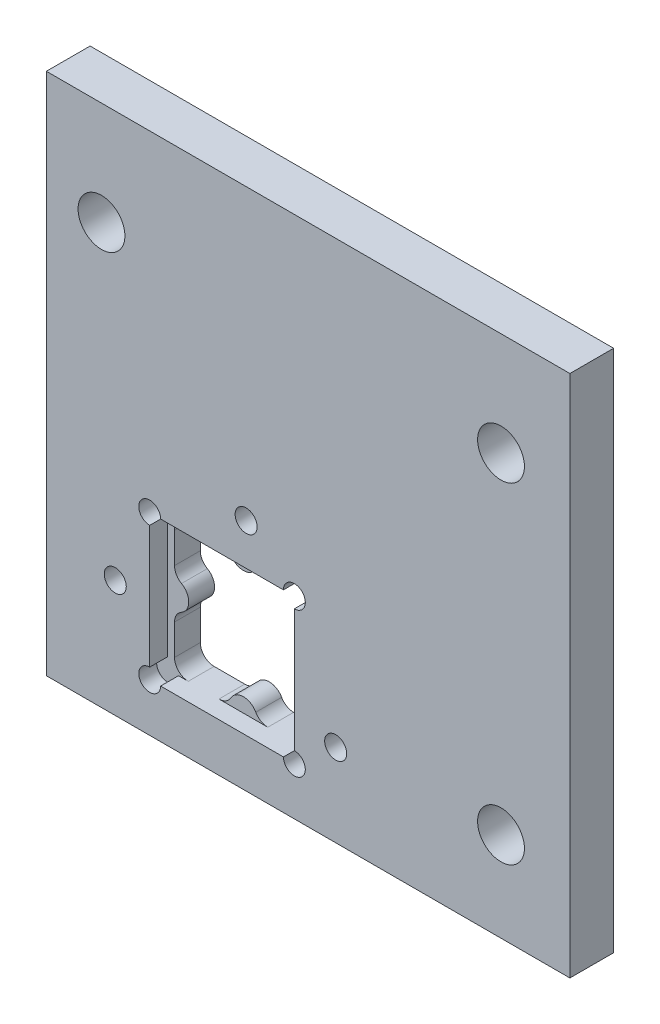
ISO-10303-21;
HEADER;
FILE_DESCRIPTION(('STEP AP214'),'2;1');
FILE_NAME('part.step','',(''),(''),'','','');
FILE_SCHEMA(('AUTOMOTIVE_DESIGN { 1 0 10303 214 1 1 1 1 }'));
ENDSEC;
DATA;
#1=APPLICATION_CONTEXT('core data for automotive mechanical design processes');
#2=APPLICATION_PROTOCOL_DEFINITION('international standard','automotive_design',2000,#1);
#3=PRODUCT_CONTEXT('',#1,'mechanical');
#4=PRODUCT('Part','Part','',(#3));
#5=PRODUCT_RELATED_PRODUCT_CATEGORY('part','',(#4));
#6=PRODUCT_DEFINITION_FORMATION('','',#4);
#7=PRODUCT_DEFINITION_CONTEXT('part definition',#1,'design');
#8=PRODUCT_DEFINITION('design','',#6,#7);
#9=PRODUCT_DEFINITION_SHAPE('','',#8);
#10=(LENGTH_UNIT() NAMED_UNIT(*) SI_UNIT(.MILLI.,.METRE.));
#11=(NAMED_UNIT(*) PLANE_ANGLE_UNIT() SI_UNIT($,.RADIAN.));
#12=(NAMED_UNIT(*) SI_UNIT($,.STERADIAN.) SOLID_ANGLE_UNIT());
#13=UNCERTAINTY_MEASURE_WITH_UNIT(LENGTH_MEASURE(1.E-05),#10,'distance_accuracy_value','');
#14=(GEOMETRIC_REPRESENTATION_CONTEXT(3) GLOBAL_UNCERTAINTY_ASSIGNED_CONTEXT((#13)) GLOBAL_UNIT_ASSIGNED_CONTEXT((#10,
#11,#12)) REPRESENTATION_CONTEXT('',''));
#15=CARTESIAN_POINT('',(0.,0.,0.));
#16=DIRECTION('',(0.,0.,1.));
#17=DIRECTION('',(1.,0.,0.));
#18=AXIS2_PLACEMENT_3D('',#15,#16,#17);
#19=CARTESIAN_POINT('',(0.,0.,1.875));
#20=DIRECTION('',(0.,0.,1.));
#21=DIRECTION('',(1.,0.,0.));
#22=AXIS2_PLACEMENT_3D('',#19,#20,#21);
#23=PLANE('',#22);
#24=CARTESIAN_POINT('',(-1.,-15.5,1.875));
#25=DIRECTION('',(0.,0.,1.));
#26=DIRECTION('',(1.,0.,0.));
#27=AXIS2_PLACEMENT_3D('',#24,#25,#26);
#28=CIRCLE('',#27,0.793749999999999);
#29=CARTESIAN_POINT('',(-1.,-14.70625,1.875));
#30=VERTEX_POINT('',#29);
#31=CARTESIAN_POINT('',(-1.02156246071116,-14.7065429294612,1.875));
#32=VERTEX_POINT('',#31);
#33=EDGE_CURVE('E676',#30,#32,#28,.T.);
#34=ORIENTED_EDGE('',*,*,#33,.F.);
#35=DIRECTION('',(0.,1.,0.));
#36=VECTOR('',#35,1.);
#37=CARTESIAN_POINT('',(-1.,-5.,1.875));
#38=LINE('',#37,#36);
#39=CARTESIAN_POINT('',(-1.,-14.5,1.875));
#40=VERTEX_POINT('',#39);
#41=EDGE_CURVE('E295',#30,#40,#38,.T.);
#42=ORIENTED_EDGE('',*,*,#41,.T.);
#43=CARTESIAN_POINT('',(-2.,-14.5,1.875));
#44=DIRECTION('',(0.,0.,1.));
#45=DIRECTION('',(1.,0.,0.));
#46=AXIS2_PLACEMENT_3D('',#43,#44,#45);
#47=CIRCLE('',#46,1.);
#48=EDGE_CURVE('E337',#40,#32,#47,.F.);
#49=ORIENTED_EDGE('',*,*,#48,.T.);
#50=EDGE_LOOP('',(#34,#42,#49));
#51=FACE_BOUND('',#50,.T.);
#52=ADVANCED_FACE('F37',(#51),#23,.T.);
#53=CARTESIAN_POINT('',(0.,0.,3.175));
#54=DIRECTION('',(0.,0.,-1.));
#55=DIRECTION('',(-1.,0.,0.));
#56=AXIS2_PLACEMENT_3D('',#53,#54,#55);
#57=PLANE('',#56);
#58=DIRECTION('',(0.,1.,0.));
#59=VECTOR('',#58,1.);
#60=CARTESIAN_POINT('',(19.,-19.,3.175));
#61=LINE('',#60,#59);
#62=CARTESIAN_POINT('',(19.,-19.,3.175));
#63=VERTEX_POINT('',#62);
#64=CARTESIAN_POINT('',(19.,19.,3.175));
#65=VERTEX_POINT('',#64);
#66=EDGE_CURVE('E389',#63,#65,#61,.T.);
#67=ORIENTED_EDGE('',*,*,#66,.T.);
#68=DIRECTION('',(-1.,0.,0.));
#69=VECTOR('',#68,1.);
#70=CARTESIAN_POINT('',(-19.,19.,3.175));
#71=LINE('',#70,#69);
#72=CARTESIAN_POINT('',(-19.,19.,3.175));
#73=VERTEX_POINT('',#72);
#74=EDGE_CURVE('E392',#65,#73,#71,.T.);
#75=ORIENTED_EDGE('',*,*,#74,.T.);
#76=DIRECTION('',(0.,-1.,0.));
#77=VECTOR('',#76,1.);
#78=CARTESIAN_POINT('',(-19.,-19.,3.175));
#79=LINE('',#78,#77);
#80=CARTESIAN_POINT('',(-19.,-19.,3.175));
#81=VERTEX_POINT('',#80);
#82=EDGE_CURVE('E395',#73,#81,#79,.T.);
#83=ORIENTED_EDGE('',*,*,#82,.T.);
#84=DIRECTION('',(1.,0.,0.));
#85=VECTOR('',#84,1.);
#86=CARTESIAN_POINT('',(-19.,-19.,3.175));
#87=LINE('',#86,#85);
#88=EDGE_CURVE('E397',#81,#63,#87,.T.);
#89=ORIENTED_EDGE('',*,*,#88,.T.);
#90=EDGE_LOOP('',(#67,#75,#83,#89));
#91=FACE_BOUND('',#90,.T.);
#92=CARTESIAN_POINT('',(2.,-13.,3.175));
#93=DIRECTION('',(0.,0.,1.));
#94=DIRECTION('',(1.,0.,0.));
#95=AXIS2_PLACEMENT_3D('',#92,#93,#94);
#96=CIRCLE('',#95,0.799999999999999);
#97=CARTESIAN_POINT('',(2.8,-13.,3.175));
#98=VERTEX_POINT('',#97);
#99=EDGE_CURVE('E758',#98,#98,#96,.T.);
#100=ORIENTED_EDGE('',*,*,#99,.F.);
#101=EDGE_LOOP('',(#100));
#102=FACE_BOUND('',#101,.T.);
#103=CARTESIAN_POINT('',(-4.5,-2.,3.175));
#104=DIRECTION('',(0.,0.,1.));
#105=DIRECTION('',(1.,0.,0.));
#106=AXIS2_PLACEMENT_3D('',#103,#104,#105);
#107=CIRCLE('',#106,0.799999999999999);
#108=CARTESIAN_POINT('',(-3.7,-2.,3.175));
#109=VERTEX_POINT('',#108);
#110=EDGE_CURVE('E764',#109,#109,#107,.T.);
#111=ORIENTED_EDGE('',*,*,#110,.F.);
#112=EDGE_LOOP('',(#111));
#113=FACE_BOUND('',#112,.T.);
#114=CARTESIAN_POINT('',(-14.,-10.5,3.175));
#115=DIRECTION('',(0.,0.,1.));
#116=DIRECTION('',(1.,0.,0.));
#117=AXIS2_PLACEMENT_3D('',#114,#115,#116);
#118=CIRCLE('',#117,0.799999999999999);
#119=CARTESIAN_POINT('',(-13.2,-10.5,3.175));
#120=VERTEX_POINT('',#119);
#121=EDGE_CURVE('E770',#120,#120,#118,.T.);
#122=ORIENTED_EDGE('',*,*,#121,.F.);
#123=EDGE_LOOP('',(#122));
#124=FACE_BOUND('',#123,.T.);
#125=CARTESIAN_POINT('',(14.,-12.5,3.175));
#126=DIRECTION('',(0.,0.,1.));
#127=DIRECTION('',(1.,0.,0.));
#128=AXIS2_PLACEMENT_3D('',#125,#126,#127);
#129=CIRCLE('',#128,1.7);
#130=CARTESIAN_POINT('',(15.7,-12.5,3.175));
#131=VERTEX_POINT('',#130);
#132=EDGE_CURVE('E774',#131,#131,#129,.T.);
#133=ORIENTED_EDGE('',*,*,#132,.F.);
#134=EDGE_LOOP('',(#133));
#135=FACE_BOUND('',#134,.T.);
#136=CARTESIAN_POINT('',(14.,11.5,3.175));
#137=DIRECTION('',(0.,0.,1.));
#138=DIRECTION('',(1.,0.,0.));
#139=AXIS2_PLACEMENT_3D('',#136,#137,#138);
#140=CIRCLE('',#139,1.7);
#141=CARTESIAN_POINT('',(15.7,11.5,3.175));
#142=VERTEX_POINT('',#141);
#143=EDGE_CURVE('E780',#142,#142,#140,.T.);
#144=ORIENTED_EDGE('',*,*,#143,.F.);
#145=EDGE_LOOP('',(#144));
#146=FACE_BOUND('',#145,.T.);
#147=CARTESIAN_POINT('',(-15.,11.5,3.175));
#148=DIRECTION('',(0.,0.,1.));
#149=DIRECTION('',(1.,0.,0.));
#150=AXIS2_PLACEMENT_3D('',#147,#148,#149);
#151=CIRCLE('',#150,1.7);
#152=CARTESIAN_POINT('',(-13.3,11.5,3.175));
#153=VERTEX_POINT('',#152);
#154=EDGE_CURVE('E786',#153,#153,#151,.T.);
#155=ORIENTED_EDGE('',*,*,#154,.F.);
#156=EDGE_LOOP('',(#155));
#157=FACE_BOUND('',#156,.T.);
#158=DIRECTION('',(0.,-1.,0.));
#159=VECTOR('',#158,1.);
#160=CARTESIAN_POINT('',(-11.5,-5.,3.175));
#161=LINE('',#160,#159);
#162=CARTESIAN_POINT('',(-11.5,-5.79374999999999,3.175));
#163=VERTEX_POINT('',#162);
#164=CARTESIAN_POINT('',(-11.5,-14.70625,3.175));
#165=VERTEX_POINT('',#164);
#166=EDGE_CURVE('E304',#163,#165,#161,.T.);
#167=ORIENTED_EDGE('',*,*,#166,.F.);
#168=CARTESIAN_POINT('',(-11.5,-5.,3.175));
#169=DIRECTION('',(0.,0.,1.));
#170=DIRECTION('',(1.,0.,0.));
#171=AXIS2_PLACEMENT_3D('',#168,#169,#170);
#172=CIRCLE('',#171,0.793749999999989);
#173=CARTESIAN_POINT('',(-10.70625,-5.,3.175));
#174=VERTEX_POINT('',#173);
#175=EDGE_CURVE('E281',#174,#163,#172,.T.);
#176=ORIENTED_EDGE('',*,*,#175,.F.);
#177=DIRECTION('',(-1.,0.,0.));
#178=VECTOR('',#177,1.);
#179=CARTESIAN_POINT('',(-11.5,-5.,3.175));
#180=LINE('',#179,#178);
#181=CARTESIAN_POINT('',(-1.79374999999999,-5.,3.175));
#182=VERTEX_POINT('',#181);
#183=EDGE_CURVE('E290',#182,#174,#180,.T.);
#184=ORIENTED_EDGE('',*,*,#183,.F.);
#185=CARTESIAN_POINT('',(-1.,-5.,3.175));
#186=DIRECTION('',(0.,0.,1.));
#187=DIRECTION('',(1.,0.,0.));
#188=AXIS2_PLACEMENT_3D('',#185,#186,#187);
#189=CIRCLE('',#188,0.793749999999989);
#190=CARTESIAN_POINT('',(-1.00000000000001,-5.79374999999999,3.175));
#191=VERTEX_POINT('',#190);
#192=EDGE_CURVE('E291',#191,#182,#189,.T.);
#193=ORIENTED_EDGE('',*,*,#192,.F.);
#194=DIRECTION('',(0.,1.,0.));
#195=VECTOR('',#194,1.);
#196=CARTESIAN_POINT('',(-1.,-15.5,3.175));
#197=LINE('',#196,#195);
#198=CARTESIAN_POINT('',(-1.00000000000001,-14.70625,3.175));
#199=VERTEX_POINT('',#198);
#200=EDGE_CURVE('E351',#199,#191,#197,.T.);
#201=ORIENTED_EDGE('',*,*,#200,.F.);
#202=CARTESIAN_POINT('',(-1.,-15.5,3.175));
#203=DIRECTION('',(0.,0.,1.));
#204=DIRECTION('',(1.,0.,0.));
#205=AXIS2_PLACEMENT_3D('',#202,#203,#204);
#206=CIRCLE('',#205,0.793749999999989);
#207=CARTESIAN_POINT('',(-1.79374999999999,-15.5,3.175));
#208=VERTEX_POINT('',#207);
#209=EDGE_CURVE('E803',#208,#199,#206,.T.);
#210=ORIENTED_EDGE('',*,*,#209,.F.);
#211=DIRECTION('',(1.,0.,0.));
#212=VECTOR('',#211,1.);
#213=CARTESIAN_POINT('',(-11.,-15.5,3.175));
#214=LINE('',#213,#212);
#215=CARTESIAN_POINT('',(-10.70625,-15.5,3.175));
#216=VERTEX_POINT('',#215);
#217=EDGE_CURVE('E346',#216,#208,#214,.T.);
#218=ORIENTED_EDGE('',*,*,#217,.F.);
#219=CARTESIAN_POINT('',(-11.5,-15.5,3.175));
#220=DIRECTION('',(0.,0.,1.));
#221=DIRECTION('',(1.,0.,0.));
#222=AXIS2_PLACEMENT_3D('',#219,#220,#221);
#223=CIRCLE('',#222,0.793749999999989);
#224=EDGE_CURVE('E795',#165,#216,#223,.T.);
#225=ORIENTED_EDGE('',*,*,#224,.F.);
#226=EDGE_LOOP('',(#167,#176,#184,#193,#201,#210,#218,#225));
#227=FACE_BOUND('',#226,.T.);
#228=ADVANCED_FACE('F571',(#91,#102,#113,#124,#135,#146,#157,#227),#57,.F.);
#229=CARTESIAN_POINT('',(-1.00000000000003,-10.5,0.));
#230=DIRECTION('',(0.,0.,1.));
#231=DIRECTION('',(1.,0.,0.));
#232=AXIS2_PLACEMENT_3D('',#229,#230,#231);
#233=CYLINDRICAL_SURFACE('',#232,1.03553390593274);
#234=CARTESIAN_POINT('',(-1.00000000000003,-10.5,1.875));
#235=DIRECTION('',(0.,0.,1.));
#236=DIRECTION('',(1.,0.,0.));
#237=AXIS2_PLACEMENT_3D('',#234,#235,#236);
#238=CIRCLE('',#237,1.03553390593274);
#239=CARTESIAN_POINT('',(-1.50872839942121,-9.59804330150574,1.875));
#240=VERTEX_POINT('',#239);
#241=CARTESIAN_POINT('',(-1.50872839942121,-11.4019566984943,1.875));
#242=VERTEX_POINT('',#241);
#243=EDGE_CURVE('E332',#240,#242,#238,.T.);
#244=ORIENTED_EDGE('',*,*,#243,.F.);
#245=DIRECTION('',(0.,0.,1.));
#246=VECTOR('',#245,1.);
#247=CARTESIAN_POINT('',(-1.50872839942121,-9.59804330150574,0.));
#248=LINE('',#247,#246);
#249=CARTESIAN_POINT('',(-1.50872839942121,-9.59804330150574,0.));
#250=VERTEX_POINT('',#249);
#251=EDGE_CURVE('E453',#240,#250,#248,.F.);
#252=ORIENTED_EDGE('',*,*,#251,.T.);
#253=CARTESIAN_POINT('',(-1.00000000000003,-10.5,0.));
#254=DIRECTION('',(0.,0.,-1.));
#255=DIRECTION('',(1.,0.,0.));
#256=AXIS2_PLACEMENT_3D('',#253,#254,#255);
#257=CIRCLE('',#256,1.03553390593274);
#258=CARTESIAN_POINT('',(-1.50872839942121,-11.4019566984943,0.));
#259=VERTEX_POINT('',#258);
#260=EDGE_CURVE('E381',#259,#250,#257,.T.);
#261=ORIENTED_EDGE('',*,*,#260,.F.);
#262=DIRECTION('',(0.,0.,1.));
#263=VECTOR('',#262,1.);
#264=CARTESIAN_POINT('',(-1.50872839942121,-11.4019566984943,0.));
#265=LINE('',#264,#263);
#266=EDGE_CURVE('E455',#259,#242,#265,.T.);
#267=ORIENTED_EDGE('',*,*,#266,.T.);
#268=EDGE_LOOP('',(#244,#252,#261,#267));
#269=FACE_BOUND('',#268,.T.);
#270=ADVANCED_FACE('F567',(#269),#233,.T.);
#271=CARTESIAN_POINT('',(-6.00000000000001,-15.5,0.));
#272=DIRECTION('',(0.,0.,1.));
#273=DIRECTION('',(1.,0.,0.));
#274=AXIS2_PLACEMENT_3D('',#271,#272,#273);
#275=CYLINDRICAL_SURFACE('',#274,1.03553390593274);
#276=CARTESIAN_POINT('',(-6.00000000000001,-15.5,1.875));
#277=DIRECTION('',(0.,0.,1.));
#278=DIRECTION('',(1.,0.,0.));
#279=AXIS2_PLACEMENT_3D('',#276,#277,#278);
#280=CIRCLE('',#279,1.03553390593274);
#281=CARTESIAN_POINT('',(-5.09804330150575,-14.9912716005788,1.875));
#282=VERTEX_POINT('',#281);
#283=CARTESIAN_POINT('',(-6.90195669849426,-14.9912716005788,1.875));
#284=VERTEX_POINT('',#283);
#285=EDGE_CURVE('E342',#282,#284,#280,.T.);
#286=ORIENTED_EDGE('',*,*,#285,.F.);
#287=DIRECTION('',(0.,0.,1.));
#288=VECTOR('',#287,1.);
#289=CARTESIAN_POINT('',(-5.09804330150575,-14.9912716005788,0.));
#290=LINE('',#289,#288);
#291=CARTESIAN_POINT('',(-5.09804330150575,-14.9912716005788,0.));
#292=VERTEX_POINT('',#291);
#293=EDGE_CURVE('E438',#282,#292,#290,.F.);
#294=ORIENTED_EDGE('',*,*,#293,.T.);
#295=CARTESIAN_POINT('',(-6.00000000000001,-15.5,0.));
#296=DIRECTION('',(0.,0.,-1.));
#297=DIRECTION('',(-1.,0.,0.));
#298=AXIS2_PLACEMENT_3D('',#295,#296,#297);
#299=CIRCLE('',#298,1.03553390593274);
#300=CARTESIAN_POINT('',(-6.90195669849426,-14.9912716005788,0.));
#301=VERTEX_POINT('',#300);
#302=EDGE_CURVE('E372',#301,#292,#299,.T.);
#303=ORIENTED_EDGE('',*,*,#302,.F.);
#304=DIRECTION('',(0.,0.,1.));
#305=VECTOR('',#304,1.);
#306=CARTESIAN_POINT('',(-6.90195669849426,-14.9912716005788,0.));
#307=LINE('',#306,#305);
#308=EDGE_CURVE('E440',#301,#284,#307,.T.);
#309=ORIENTED_EDGE('',*,*,#308,.T.);
#310=EDGE_LOOP('',(#286,#294,#303,#309));
#311=FACE_BOUND('',#310,.T.);
#312=ADVANCED_FACE('F570',(#311),#275,.T.);
#313=CARTESIAN_POINT('',(-11.,-11.5355339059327,0.));
#314=DIRECTION('',(-1.,0.,0.));
#315=DIRECTION('',(0.,0.,1.));
#316=AXIS2_PLACEMENT_3D('',#313,#314,#315);
#317=PLANE('',#316);
#318=DIRECTION('',(0.,1.,0.));
#319=VECTOR('',#318,1.);
#320=CARTESIAN_POINT('',(-11.,-11.5355339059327,1.875));
#321=LINE('',#320,#319);
#322=CARTESIAN_POINT('',(-11.,-14.5,1.875));
#323=VERTEX_POINT('',#322);
#324=CARTESIAN_POINT('',(-11.,-12.2729631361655,1.875));
#325=VERTEX_POINT('',#324);
#326=EDGE_CURVE('E324',#323,#325,#321,.T.);
#327=ORIENTED_EDGE('',*,*,#326,.F.);
#328=DIRECTION('',(0.,0.,1.));
#329=VECTOR('',#328,1.);
#330=CARTESIAN_POINT('',(-11.,-14.5,0.));
#331=LINE('',#330,#329);
#332=CARTESIAN_POINT('',(-11.,-14.5,0.));
#333=VERTEX_POINT('',#332);
#334=EDGE_CURVE('E428',#323,#333,#331,.F.);
#335=ORIENTED_EDGE('',*,*,#334,.T.);
#336=DIRECTION('',(0.,-1.,0.));
#337=VECTOR('',#336,1.);
#338=CARTESIAN_POINT('',(-11.,-11.5355339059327,0.));
#339=LINE('',#338,#337);
#340=CARTESIAN_POINT('',(-11.,-12.2729631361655,0.));
#341=VERTEX_POINT('',#340);
#342=EDGE_CURVE('E366',#341,#333,#339,.T.);
#343=ORIENTED_EDGE('',*,*,#342,.F.);
#344=DIRECTION('',(0.,0.,-1.));
#345=VECTOR('',#344,1.);
#346=CARTESIAN_POINT('',(-11.,-12.2729631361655,3.175));
#347=LINE('',#346,#345);
#348=EDGE_CURVE('E430',#341,#325,#347,.F.);
#349=ORIENTED_EDGE('',*,*,#348,.T.);
#350=EDGE_LOOP('',(#327,#335,#343,#349));
#351=FACE_BOUND('',#350,.T.);
#352=ADVANCED_FACE('F580',(#351),#317,.F.);
#353=CARTESIAN_POINT('',(-11.,-10.5,0.));
#354=DIRECTION('',(0.,0.,1.));
#355=DIRECTION('',(1.,0.,0.));
#356=AXIS2_PLACEMENT_3D('',#353,#354,#355);
#357=CYLINDRICAL_SURFACE('',#356,1.03553390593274);
#358=CARTESIAN_POINT('',(-11.,-10.5,1.875));
#359=DIRECTION('',(0.,0.,1.));
#360=DIRECTION('',(1.,0.,0.));
#361=AXIS2_PLACEMENT_3D('',#358,#359,#360);
#362=CIRCLE('',#361,1.03553390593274);
#363=CARTESIAN_POINT('',(-10.4912716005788,-11.4019566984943,1.875));
#364=VERTEX_POINT('',#363);
#365=CARTESIAN_POINT('',(-10.4912716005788,-9.59804330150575,1.875));
#366=VERTEX_POINT('',#365);
#367=EDGE_CURVE('E316',#364,#366,#362,.T.);
#368=ORIENTED_EDGE('',*,*,#367,.F.);
#369=DIRECTION('',(0.,0.,1.));
#370=VECTOR('',#369,1.);
#371=CARTESIAN_POINT('',(-10.4912716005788,-11.4019566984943,0.));
#372=LINE('',#371,#370);
#373=CARTESIAN_POINT('',(-10.4912716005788,-11.4019566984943,0.));
#374=VERTEX_POINT('',#373);
#375=EDGE_CURVE('E418',#364,#374,#372,.F.);
#376=ORIENTED_EDGE('',*,*,#375,.T.);
#377=CARTESIAN_POINT('',(-11.,-10.5,0.));
#378=DIRECTION('',(0.,0.,-1.));
#379=DIRECTION('',(1.,0.,0.));
#380=AXIS2_PLACEMENT_3D('',#377,#378,#379);
#381=CIRCLE('',#380,1.03553390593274);
#382=CARTESIAN_POINT('',(-10.4912716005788,-9.59804330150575,0.));
#383=VERTEX_POINT('',#382);
#384=EDGE_CURVE('E363',#383,#374,#381,.T.);
#385=ORIENTED_EDGE('',*,*,#384,.F.);
#386=DIRECTION('',(0.,0.,1.));
#387=VECTOR('',#386,1.);
#388=CARTESIAN_POINT('',(-10.4912716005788,-9.59804330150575,0.));
#389=LINE('',#388,#387);
#390=EDGE_CURVE('E420',#383,#366,#389,.T.);
#391=ORIENTED_EDGE('',*,*,#390,.T.);
#392=EDGE_LOOP('',(#368,#376,#385,#391));
#393=FACE_BOUND('',#392,.T.);
#394=ADVANCED_FACE('F584',(#393),#357,.T.);
#395=CARTESIAN_POINT('',(-11.,-5.5,0.));
#396=DIRECTION('',(-1.,0.,0.));
#397=DIRECTION('',(0.,0.,1.));
#398=AXIS2_PLACEMENT_3D('',#395,#396,#397);
#399=PLANE('',#398);
#400=DIRECTION('',(0.,1.,0.));
#401=VECTOR('',#400,1.);
#402=CARTESIAN_POINT('',(-11.,-5.5,1.875));
#403=LINE('',#402,#401);
#404=CARTESIAN_POINT('',(-11.,-8.72703686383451,1.875));
#405=VERTEX_POINT('',#404);
#406=CARTESIAN_POINT('',(-11.,-6.5,1.875));
#407=VERTEX_POINT('',#406);
#408=EDGE_CURVE('E297',#405,#407,#403,.T.);
#409=ORIENTED_EDGE('',*,*,#408,.F.);
#410=DIRECTION('',(0.,0.,-1.));
#411=VECTOR('',#410,1.);
#412=CARTESIAN_POINT('',(-11.,-8.72703686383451,0.));
#413=LINE('',#412,#411);
#414=CARTESIAN_POINT('',(-11.,-8.72703686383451,0.));
#415=VERTEX_POINT('',#414);
#416=EDGE_CURVE('E426',#405,#415,#413,.T.);
#417=ORIENTED_EDGE('',*,*,#416,.T.);
#418=DIRECTION('',(0.,-1.,0.));
#419=VECTOR('',#418,1.);
#420=CARTESIAN_POINT('',(-11.,-5.5,0.));
#421=LINE('',#420,#419);
#422=CARTESIAN_POINT('',(-11.,-6.5,0.));
#423=VERTEX_POINT('',#422);
#424=EDGE_CURVE('E360',#423,#415,#421,.T.);
#425=ORIENTED_EDGE('',*,*,#424,.F.);
#426=DIRECTION('',(0.,0.,1.));
#427=VECTOR('',#426,1.);
#428=CARTESIAN_POINT('',(-11.,-6.5,3.175));
#429=LINE('',#428,#427);
#430=EDGE_CURVE('E423',#423,#407,#429,.T.);
#431=ORIENTED_EDGE('',*,*,#430,.T.);
#432=EDGE_LOOP('',(#409,#417,#425,#431));
#433=FACE_BOUND('',#432,.T.);
#434=ADVANCED_FACE('F588',(#433),#399,.F.);
#435=CARTESIAN_POINT('',(-11.,-5.5,0.));
#436=DIRECTION('',(0.,1.,0.));
#437=DIRECTION('',(-1.,0.,0.));
#438=AXIS2_PLACEMENT_3D('',#435,#436,#437);
#439=PLANE('',#438);
#440=DIRECTION('',(1.,0.,0.));
#441=VECTOR('',#440,1.);
#442=CARTESIAN_POINT('',(-11.,-5.5,1.875));
#443=LINE('',#442,#441);
#444=CARTESIAN_POINT('',(-10.,-5.5,1.875));
#445=VERTEX_POINT('',#444);
#446=CARTESIAN_POINT('',(-7.7729631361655,-5.5,1.875));
#447=VERTEX_POINT('',#446);
#448=EDGE_CURVE('E294',#445,#447,#443,.T.);
#449=ORIENTED_EDGE('',*,*,#448,.F.);
#450=DIRECTION('',(0.,0.,1.));
#451=VECTOR('',#450,1.);
#452=CARTESIAN_POINT('',(-10.,-5.5,0.));
#453=LINE('',#452,#451);
#454=CARTESIAN_POINT('',(-10.,-5.5,0.));
#455=VERTEX_POINT('',#454);
#456=EDGE_CURVE('E473',#445,#455,#453,.F.);
#457=ORIENTED_EDGE('',*,*,#456,.T.);
#458=DIRECTION('',(-1.,0.,0.));
#459=VECTOR('',#458,1.);
#460=CARTESIAN_POINT('',(-11.,-5.5,0.));
#461=LINE('',#460,#459);
#462=CARTESIAN_POINT('',(-7.7729631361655,-5.5,0.));
#463=VERTEX_POINT('',#462);
#464=EDGE_CURVE('E357',#463,#455,#461,.T.);
#465=ORIENTED_EDGE('',*,*,#464,.F.);
#466=DIRECTION('',(0.,0.,-1.));
#467=VECTOR('',#466,1.);
#468=CARTESIAN_POINT('',(-7.7729631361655,-5.5,3.175));
#469=LINE('',#468,#467);
#470=EDGE_CURVE('E475',#463,#447,#469,.F.);
#471=ORIENTED_EDGE('',*,*,#470,.T.);
#472=EDGE_LOOP('',(#449,#457,#465,#471));
#473=FACE_BOUND('',#472,.T.);
#474=ADVANCED_FACE('F592',(#473),#439,.F.);
#475=CARTESIAN_POINT('',(-6.00000000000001,-5.5,0.));
#476=DIRECTION('',(0.,0.,1.));
#477=DIRECTION('',(1.,0.,0.));
#478=AXIS2_PLACEMENT_3D('',#475,#476,#477);
#479=CYLINDRICAL_SURFACE('',#478,1.03553390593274);
#480=CARTESIAN_POINT('',(-6.00000000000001,-5.5,1.875));
#481=DIRECTION('',(0.,0.,1.));
#482=DIRECTION('',(1.,0.,0.));
#483=AXIS2_PLACEMENT_3D('',#480,#481,#482);
#484=CIRCLE('',#483,1.03553390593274);
#485=CARTESIAN_POINT('',(-6.90195669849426,-6.00872839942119,1.875));
#486=VERTEX_POINT('',#485);
#487=CARTESIAN_POINT('',(-5.09804330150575,-6.00872839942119,1.875));
#488=VERTEX_POINT('',#487);
#489=EDGE_CURVE('E314',#486,#488,#484,.T.);
#490=ORIENTED_EDGE('',*,*,#489,.F.);
#491=DIRECTION('',(0.,0.,1.));
#492=VECTOR('',#491,1.);
#493=CARTESIAN_POINT('',(-6.90195669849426,-6.00872839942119,0.));
#494=LINE('',#493,#492);
#495=CARTESIAN_POINT('',(-6.90195669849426,-6.00872839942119,0.));
#496=VERTEX_POINT('',#495);
#497=EDGE_CURVE('E468',#486,#496,#494,.F.);
#498=ORIENTED_EDGE('',*,*,#497,.T.);
#499=CARTESIAN_POINT('',(-6.00000000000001,-5.5,0.));
#500=DIRECTION('',(0.,0.,-1.));
#501=DIRECTION('',(-1.,0.,0.));
#502=AXIS2_PLACEMENT_3D('',#499,#500,#501);
#503=CIRCLE('',#502,1.03553390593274);
#504=CARTESIAN_POINT('',(-5.09804330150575,-6.00872839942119,0.));
#505=VERTEX_POINT('',#504);
#506=EDGE_CURVE('E354',#505,#496,#503,.T.);
#507=ORIENTED_EDGE('',*,*,#506,.F.);
#508=DIRECTION('',(0.,0.,1.));
#509=VECTOR('',#508,1.);
#510=CARTESIAN_POINT('',(-5.09804330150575,-6.00872839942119,0.));
#511=LINE('',#510,#509);
#512=EDGE_CURVE('E470',#505,#488,#511,.T.);
#513=ORIENTED_EDGE('',*,*,#512,.T.);
#514=EDGE_LOOP('',(#490,#498,#507,#513));
#515=FACE_BOUND('',#514,.T.);
#516=ADVANCED_FACE('F596',(#515),#479,.T.);
#517=CARTESIAN_POINT('',(-4.96446609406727,-5.5,0.));
#518=DIRECTION('',(0.,1.,0.));
#519=DIRECTION('',(-1.,0.,0.));
#520=AXIS2_PLACEMENT_3D('',#517,#518,#519);
#521=PLANE('',#520);
#522=DIRECTION('',(1.,0.,0.));
#523=VECTOR('',#522,1.);
#524=CARTESIAN_POINT('',(-4.96446609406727,-5.5,1.875));
#525=LINE('',#524,#523);
#526=CARTESIAN_POINT('',(-4.22703686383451,-5.5,1.875));
#527=VERTEX_POINT('',#526);
#528=CARTESIAN_POINT('',(-2.,-5.5,1.875));
#529=VERTEX_POINT('',#528);
#530=EDGE_CURVE('E322',#527,#529,#525,.T.);
#531=ORIENTED_EDGE('',*,*,#530,.F.);
#532=DIRECTION('',(0.,0.,-1.));
#533=VECTOR('',#532,1.);
#534=CARTESIAN_POINT('',(-4.22703686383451,-5.5,0.));
#535=LINE('',#534,#533);
#536=CARTESIAN_POINT('',(-4.22703686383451,-5.5,0.));
#537=VERTEX_POINT('',#536);
#538=EDGE_CURVE('E463',#527,#537,#535,.T.);
#539=ORIENTED_EDGE('',*,*,#538,.T.);
#540=DIRECTION('',(-1.,0.,0.));
#541=VECTOR('',#540,1.);
#542=CARTESIAN_POINT('',(-4.96446609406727,-5.5,0.));
#543=LINE('',#542,#541);
#544=CARTESIAN_POINT('',(-2.,-5.5,0.));
#545=VERTEX_POINT('',#544);
#546=EDGE_CURVE('E350',#545,#537,#543,.T.);
#547=ORIENTED_EDGE('',*,*,#546,.F.);
#548=DIRECTION('',(0.,0.,1.));
#549=VECTOR('',#548,1.);
#550=CARTESIAN_POINT('',(-2.,-5.5,3.175));
#551=LINE('',#550,#549);
#552=EDGE_CURVE('E465',#545,#529,#551,.T.);
#553=ORIENTED_EDGE('',*,*,#552,.T.);
#554=EDGE_LOOP('',(#531,#539,#547,#553));
#555=FACE_BOUND('',#554,.T.);
#556=ADVANCED_FACE('F600',(#555),#521,.F.);
#557=CARTESIAN_POINT('',(-10.,-8.72703686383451,0.));
#558=DIRECTION('',(0.,0.,1.));
#559=DIRECTION('',(1.,0.,0.));
#560=AXIS2_PLACEMENT_3D('',#557,#558,#559);
#561=CYLINDRICAL_SURFACE('',#560,1.);
#562=CARTESIAN_POINT('',(-10.,-8.72703686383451,1.875));
#563=DIRECTION('',(0.,0.,1.));
#564=DIRECTION('',(1.,0.,0.));
#565=AXIS2_PLACEMENT_3D('',#562,#563,#564);
#566=CIRCLE('',#565,1.);
#567=EDGE_CURVE('E312',#366,#405,#566,.F.);
#568=ORIENTED_EDGE('',*,*,#567,.F.);
#569=ORIENTED_EDGE('',*,*,#390,.F.);
#570=CARTESIAN_POINT('',(-10.,-8.72703686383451,0.));
#571=DIRECTION('',(0.,0.,-1.));
#572=DIRECTION('',(-1.,0.,0.));
#573=AXIS2_PLACEMENT_3D('',#570,#571,#572);
#574=CIRCLE('',#573,1.);
#575=EDGE_CURVE('E478',#415,#383,#574,.F.);
#576=ORIENTED_EDGE('',*,*,#575,.F.);
#577=ORIENTED_EDGE('',*,*,#416,.F.);
#578=EDGE_LOOP('',(#568,#569,#576,#577));
#579=FACE_BOUND('',#578,.T.);
#580=ADVANCED_FACE('F604',(#579),#561,.F.);
#581=CARTESIAN_POINT('',(-10.,-12.2729631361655,0.));
#582=DIRECTION('',(0.,0.,1.));
#583=DIRECTION('',(1.,0.,0.));
#584=AXIS2_PLACEMENT_3D('',#581,#582,#583);
#585=CYLINDRICAL_SURFACE('',#584,1.);
#586=CARTESIAN_POINT('',(-10.,-12.2729631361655,1.875));
#587=DIRECTION('',(0.,0.,1.));
#588=DIRECTION('',(1.,0.,0.));
#589=AXIS2_PLACEMENT_3D('',#586,#587,#588);
#590=CIRCLE('',#589,1.);
#591=EDGE_CURVE('E320',#325,#364,#590,.F.);
#592=ORIENTED_EDGE('',*,*,#591,.F.);
#593=ORIENTED_EDGE('',*,*,#348,.F.);
#594=CARTESIAN_POINT('',(-10.,-12.2729631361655,0.));
#595=DIRECTION('',(0.,0.,-1.));
#596=DIRECTION('',(-1.,0.,0.));
#597=AXIS2_PLACEMENT_3D('',#594,#595,#596);
#598=CIRCLE('',#597,1.);
#599=EDGE_CURVE('E480',#374,#341,#598,.F.);
#600=ORIENTED_EDGE('',*,*,#599,.F.);
#601=ORIENTED_EDGE('',*,*,#375,.F.);
#602=EDGE_LOOP('',(#592,#593,#600,#601));
#603=FACE_BOUND('',#602,.T.);
#604=ADVANCED_FACE('F634',(#603),#585,.F.);
#605=CARTESIAN_POINT('',(-10.,-14.5,0.));
#606=DIRECTION('',(0.,0.,-1.));
#607=DIRECTION('',(-1.,0.,0.));
#608=AXIS2_PLACEMENT_3D('',#605,#606,#607);
#609=CYLINDRICAL_SURFACE('',#608,1.);
#610=CARTESIAN_POINT('',(-10.,-14.5,1.875));
#611=DIRECTION('',(0.,0.,1.));
#612=DIRECTION('',(1.,0.,0.));
#613=AXIS2_PLACEMENT_3D('',#610,#611,#612);
#614=CIRCLE('',#613,1.);
#615=CARTESIAN_POINT('',(-10.,-15.5,1.875));
#616=VERTEX_POINT('',#615);
#617=EDGE_CURVE('E328',#616,#323,#614,.F.);
#618=ORIENTED_EDGE('',*,*,#617,.F.);
#619=DIRECTION('',(0.,0.,1.));
#620=VECTOR('',#619,1.);
#621=CARTESIAN_POINT('',(-10.,-15.5,3.175));
#622=LINE('',#621,#620);
#623=CARTESIAN_POINT('',(-10.,-15.5,0.));
#624=VERTEX_POINT('',#623);
#625=EDGE_CURVE('E435',#624,#616,#622,.T.);
#626=ORIENTED_EDGE('',*,*,#625,.F.);
#627=CARTESIAN_POINT('',(-10.,-14.5,0.));
#628=DIRECTION('',(0.,0.,-1.));
#629=DIRECTION('',(-1.,0.,0.));
#630=AXIS2_PLACEMENT_3D('',#627,#628,#629);
#631=CIRCLE('',#630,1.);
#632=EDGE_CURVE('E482',#333,#624,#631,.F.);
#633=ORIENTED_EDGE('',*,*,#632,.F.);
#634=ORIENTED_EDGE('',*,*,#334,.F.);
#635=EDGE_LOOP('',(#618,#626,#633,#634));
#636=FACE_BOUND('',#635,.T.);
#637=ADVANCED_FACE('F638',(#636),#609,.F.);
#638=CARTESIAN_POINT('',(-7.7729631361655,-14.5,0.));
#639=DIRECTION('',(0.,0.,1.));
#640=DIRECTION('',(1.,0.,0.));
#641=AXIS2_PLACEMENT_3D('',#638,#639,#640);
#642=CYLINDRICAL_SURFACE('',#641,1.);
#643=CARTESIAN_POINT('',(-7.7729631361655,-14.5,1.875));
#644=DIRECTION('',(0.,0.,1.));
#645=DIRECTION('',(1.,0.,0.));
#646=AXIS2_PLACEMENT_3D('',#643,#644,#645);
#647=CIRCLE('',#646,1.);
#648=CARTESIAN_POINT('',(-7.7729631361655,-15.5,1.875));
#649=VERTEX_POINT('',#648);
#650=EDGE_CURVE('E344',#284,#649,#647,.F.);
#651=ORIENTED_EDGE('',*,*,#650,.F.);
#652=ORIENTED_EDGE('',*,*,#308,.F.);
#653=CARTESIAN_POINT('',(-7.7729631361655,-14.5,0.));
#654=DIRECTION('',(0.,0.,-1.));
#655=DIRECTION('',(-1.,0.,0.));
#656=AXIS2_PLACEMENT_3D('',#653,#654,#655);
#657=CIRCLE('',#656,1.);
#658=CARTESIAN_POINT('',(-7.7729631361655,-15.5,0.));
#659=VERTEX_POINT('',#658);
#660=EDGE_CURVE('E484',#659,#301,#657,.F.);
#661=ORIENTED_EDGE('',*,*,#660,.F.);
#662=DIRECTION('',(0.,0.,-1.));
#663=VECTOR('',#662,1.);
#664=CARTESIAN_POINT('',(-7.7729631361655,-15.5,0.));
#665=LINE('',#664,#663);
#666=EDGE_CURVE('E433',#649,#659,#665,.T.);
#667=ORIENTED_EDGE('',*,*,#666,.F.);
#668=EDGE_LOOP('',(#651,#652,#661,#667));
#669=FACE_BOUND('',#668,.T.);
#670=ADVANCED_FACE('F642',(#669),#642,.F.);
#671=CARTESIAN_POINT('',(-4.22703686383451,-14.5,0.));
#672=DIRECTION('',(0.,0.,1.));
#673=DIRECTION('',(1.,0.,0.));
#674=AXIS2_PLACEMENT_3D('',#671,#672,#673);
#675=CYLINDRICAL_SURFACE('',#674,1.);
#676=CARTESIAN_POINT('',(-4.22703686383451,-14.5,1.875));
#677=DIRECTION('',(0.,0.,1.));
#678=DIRECTION('',(1.,0.,0.));
#679=AXIS2_PLACEMENT_3D('',#676,#677,#678);
#680=CIRCLE('',#679,1.);
#681=CARTESIAN_POINT('',(-4.22703686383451,-15.5,1.875));
#682=VERTEX_POINT('',#681);
#683=EDGE_CURVE('E340',#682,#282,#680,.F.);
#684=ORIENTED_EDGE('',*,*,#683,.F.);
#685=DIRECTION('',(0.,0.,-1.));
#686=VECTOR('',#685,1.);
#687=CARTESIAN_POINT('',(-4.22703686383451,-15.5,3.175));
#688=LINE('',#687,#686);
#689=CARTESIAN_POINT('',(-4.22703686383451,-15.5,0.));
#690=VERTEX_POINT('',#689);
#691=EDGE_CURVE('E445',#690,#682,#688,.F.);
#692=ORIENTED_EDGE('',*,*,#691,.F.);
#693=CARTESIAN_POINT('',(-4.22703686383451,-14.5,0.));
#694=DIRECTION('',(0.,0.,-1.));
#695=DIRECTION('',(-1.,0.,0.));
#696=AXIS2_PLACEMENT_3D('',#693,#694,#695);
#697=CIRCLE('',#696,1.);
#698=EDGE_CURVE('E486',#292,#690,#697,.F.);
#699=ORIENTED_EDGE('',*,*,#698,.F.);
#700=ORIENTED_EDGE('',*,*,#293,.F.);
#701=EDGE_LOOP('',(#684,#692,#699,#700));
#702=FACE_BOUND('',#701,.T.);
#703=ADVANCED_FACE('F645',(#702),#675,.F.);
#704=CARTESIAN_POINT('',(-2.,-14.5,0.));
#705=DIRECTION('',(0.,0.,-1.));
#706=DIRECTION('',(-1.,0.,0.));
#707=AXIS2_PLACEMENT_3D('',#704,#705,#706);
#708=CYLINDRICAL_SURFACE('',#707,1.);
#709=CARTESIAN_POINT('',(-1.79345707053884,-15.4784375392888,1.875));
#710=VERTEX_POINT('',#709);
#711=CARTESIAN_POINT('',(-2.,-15.5,1.875));
#712=VERTEX_POINT('',#711);
#713=EDGE_CURVE('E336',#710,#712,#47,.F.);
#714=ORIENTED_EDGE('',*,*,#713,.F.);
#715=CARTESIAN_POINT('',(-1.79379196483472,-15.4785081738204,1.8752));
#716=CARTESIAN_POINT('',(-1.76472640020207,-15.4723737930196,1.85787832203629));
#717=CARTESIAN_POINT('',(-1.73584485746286,-15.4649434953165,1.8406737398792));
#718=CARTESIAN_POINT('',(-1.67832270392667,-15.4473327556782,1.80681082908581));
#719=CARTESIAN_POINT('',(-1.64968509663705,-15.4371338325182,1.79015704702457));
#720=CARTESIAN_POINT('',(-1.59151627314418,-15.4133328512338,1.75715841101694));
#721=CARTESIAN_POINT('',(-1.56201116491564,-15.399587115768,1.74086982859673));
#722=CARTESIAN_POINT('',(-1.50367837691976,-15.3687635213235,1.71054801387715));
#723=CARTESIAN_POINT('',(-1.47484879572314,-15.3516967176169,1.69650757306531));
#724=CARTESIAN_POINT('',(-1.42351570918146,-15.3175682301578,1.67482645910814));
#725=CARTESIAN_POINT('',(-1.40088648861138,-15.3011701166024,1.6664696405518));
#726=CARTESIAN_POINT('',(-1.35666383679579,-15.2660947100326,1.65387562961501));
#727=CARTESIAN_POINT('',(-1.33506074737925,-15.2474499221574,1.64958614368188));
#728=CARTESIAN_POINT('',(-1.29305561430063,-15.2078628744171,1.64609896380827));
#729=CARTESIAN_POINT('',(-1.27267198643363,-15.1868947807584,1.64696566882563));
#730=CARTESIAN_POINT('',(-1.23411066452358,-15.1436321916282,1.6536844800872));
#731=CARTESIAN_POINT('',(-1.21594574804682,-15.1213310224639,1.65956403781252));
#732=CARTESIAN_POINT('',(-1.17494924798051,-15.0664940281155,1.67811130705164));
#733=CARTESIAN_POINT('',(-1.15341954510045,-15.0336400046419,1.69260268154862));
#734=CARTESIAN_POINT('',(-1.11492175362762,-14.967038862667,1.72525484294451));
#735=CARTESIAN_POINT('',(-1.09797388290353,-14.9332884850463,1.74343129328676));
#736=CARTESIAN_POINT('',(-1.06929111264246,-14.8673922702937,1.78030004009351));
#737=CARTESIAN_POINT('',(-1.05727558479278,-14.8352981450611,1.79886848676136));
#738=CARTESIAN_POINT('',(-1.04190201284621,-14.7869316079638,1.82724569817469));
#739=CARTESIAN_POINT('',(-1.03723972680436,-14.7708708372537,1.8367325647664));
#740=CARTESIAN_POINT('',(-1.02874615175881,-14.7386283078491,1.8558616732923));
#741=CARTESIAN_POINT('',(-1.02491464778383,-14.7224465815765,1.86550387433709));
#742=CARTESIAN_POINT('',(-1.02149182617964,-14.7062080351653,1.8752));
#743=B_SPLINE_CURVE_WITH_KNOTS('',3,(#715,#716,#717,#718,#719,#720,#721,#722,#723,#724,#725,
#726,#727,#728,#729,#730,#731,#732,#733,#734,#735,#736,#737,#738,#739,#740,#741,#742),
.UNSPECIFIED.,.F.,.F.,(4,2,2,2,2,2,2,2,2,2,2,2,2,4),(0.,0.103161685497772,0.207029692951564,
0.316048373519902,0.424710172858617,0.511929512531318,0.598011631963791,0.685171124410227,
0.772811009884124,0.897731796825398,1.02319513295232,1.13993045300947,1.19759646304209,
1.25524753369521),.UNSPECIFIED.);
#744=EDGE_CURVE('E507',#710,#32,#743,.T.);
#745=ORIENTED_EDGE('',*,*,#744,.T.);
#746=ORIENTED_EDGE('',*,*,#48,.F.);
#747=DIRECTION('',(0.,0.,1.));
#748=VECTOR('',#747,1.);
#749=CARTESIAN_POINT('',(-1.,-14.5,3.175));
#750=LINE('',#749,#748);
#751=CARTESIAN_POINT('',(-1.,-14.5,0.));
#752=VERTEX_POINT('',#751);
#753=EDGE_CURVE('E450',#752,#40,#750,.T.);
#754=ORIENTED_EDGE('',*,*,#753,.F.);
#755=CARTESIAN_POINT('',(-2.,-14.5,0.));
#756=DIRECTION('',(0.,0.,-1.));
#757=DIRECTION('',(-1.,0.,0.));
#758=AXIS2_PLACEMENT_3D('',#755,#756,#757);
#759=CIRCLE('',#758,1.);
#760=CARTESIAN_POINT('',(-2.,-15.5,0.));
#761=VERTEX_POINT('',#760);
#762=EDGE_CURVE('E488',#761,#752,#759,.F.);
#763=ORIENTED_EDGE('',*,*,#762,.F.);
#764=DIRECTION('',(0.,0.,1.));
#765=VECTOR('',#764,1.);
#766=CARTESIAN_POINT('',(-2.,-15.5,0.));
#767=LINE('',#766,#765);
#768=EDGE_CURVE('E443',#712,#761,#767,.F.);
#769=ORIENTED_EDGE('',*,*,#768,.F.);
#770=EDGE_LOOP('',(#714,#745,#746,#754,#763,#769));
#771=FACE_BOUND('',#770,.T.);
#772=ADVANCED_FACE('F514',(#771),#708,.F.);
#773=CARTESIAN_POINT('',(-2.00000000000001,-12.2729631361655,0.));
#774=DIRECTION('',(0.,0.,1.));
#775=DIRECTION('',(1.,0.,0.));
#776=AXIS2_PLACEMENT_3D('',#773,#774,#775);
#777=CYLINDRICAL_SURFACE('',#776,1.);
#778=CARTESIAN_POINT('',(-2.00000000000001,-12.2729631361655,1.875));
#779=DIRECTION('',(0.,0.,1.));
#780=DIRECTION('',(1.,0.,0.));
#781=AXIS2_PLACEMENT_3D('',#778,#779,#780);
#782=CIRCLE('',#781,1.);
#783=CARTESIAN_POINT('',(-1.,-12.2729631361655,1.875));
#784=VERTEX_POINT('',#783);
#785=EDGE_CURVE('E334',#242,#784,#782,.F.);
#786=ORIENTED_EDGE('',*,*,#785,.F.);
#787=ORIENTED_EDGE('',*,*,#266,.F.);
#788=CARTESIAN_POINT('',(-2.00000000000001,-12.2729631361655,0.));
#789=DIRECTION('',(0.,0.,-1.));
#790=DIRECTION('',(-1.,0.,0.));
#791=AXIS2_PLACEMENT_3D('',#788,#789,#790);
#792=CIRCLE('',#791,1.);
#793=CARTESIAN_POINT('',(-1.00000000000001,-12.2729631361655,0.));
#794=VERTEX_POINT('',#793);
#795=EDGE_CURVE('E490',#794,#259,#792,.F.);
#796=ORIENTED_EDGE('',*,*,#795,.F.);
#797=DIRECTION('',(0.,0.,-1.));
#798=VECTOR('',#797,1.);
#799=CARTESIAN_POINT('',(-1.00000000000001,-12.2729631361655,0.));
#800=LINE('',#799,#798);
#801=EDGE_CURVE('E448',#784,#794,#800,.T.);
#802=ORIENTED_EDGE('',*,*,#801,.F.);
#803=EDGE_LOOP('',(#786,#787,#796,#802));
#804=FACE_BOUND('',#803,.T.);
#805=ADVANCED_FACE('F652',(#804),#777,.F.);
#806=CARTESIAN_POINT('',(-2.00000000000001,-8.72703686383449,0.));
#807=DIRECTION('',(0.,0.,1.));
#808=DIRECTION('',(1.,0.,0.));
#809=AXIS2_PLACEMENT_3D('',#806,#807,#808);
#810=CYLINDRICAL_SURFACE('',#809,1.);
#811=CARTESIAN_POINT('',(-2.00000000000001,-8.72703686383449,1.875));
#812=DIRECTION('',(0.,0.,1.));
#813=DIRECTION('',(1.,0.,0.));
#814=AXIS2_PLACEMENT_3D('',#811,#812,#813);
#815=CIRCLE('',#814,1.);
#816=CARTESIAN_POINT('',(-1.00000000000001,-8.72703686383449,1.875));
#817=VERTEX_POINT('',#816);
#818=EDGE_CURVE('E330',#817,#240,#815,.F.);
#819=ORIENTED_EDGE('',*,*,#818,.F.);
#820=DIRECTION('',(0.,0.,-1.));
#821=VECTOR('',#820,1.);
#822=CARTESIAN_POINT('',(-1.00000000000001,-8.72703686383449,3.175));
#823=LINE('',#822,#821);
#824=CARTESIAN_POINT('',(-1.00000000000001,-8.72703686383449,0.));
#825=VERTEX_POINT('',#824);
#826=EDGE_CURVE('E460',#825,#817,#823,.F.);
#827=ORIENTED_EDGE('',*,*,#826,.F.);
#828=CARTESIAN_POINT('',(-2.00000000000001,-8.72703686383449,0.));
#829=DIRECTION('',(0.,0.,-1.));
#830=DIRECTION('',(-1.,0.,0.));
#831=AXIS2_PLACEMENT_3D('',#828,#829,#830);
#832=CIRCLE('',#831,1.);
#833=EDGE_CURVE('E492',#250,#825,#832,.F.);
#834=ORIENTED_EDGE('',*,*,#833,.F.);
#835=ORIENTED_EDGE('',*,*,#251,.F.);
#836=EDGE_LOOP('',(#819,#827,#834,#835));
#837=FACE_BOUND('',#836,.T.);
#838=ADVANCED_FACE('F831',(#837),#810,.F.);
#839=CARTESIAN_POINT('',(-2.00000000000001,-6.5,0.));
#840=DIRECTION('',(0.,0.,-1.));
#841=DIRECTION('',(-1.,0.,0.));
#842=AXIS2_PLACEMENT_3D('',#839,#840,#841);
#843=CYLINDRICAL_SURFACE('',#842,1.);
#844=CARTESIAN_POINT('',(-2.00000000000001,-6.5,1.875));
#845=DIRECTION('',(0.,0.,1.));
#846=DIRECTION('',(1.,0.,0.));
#847=AXIS2_PLACEMENT_3D('',#844,#845,#846);
#848=CIRCLE('',#847,1.);
#849=CARTESIAN_POINT('',(-1.,-6.5,1.875));
#850=VERTEX_POINT('',#849);
#851=EDGE_CURVE('E326',#529,#850,#848,.F.);
#852=ORIENTED_EDGE('',*,*,#851,.F.);
#853=ORIENTED_EDGE('',*,*,#552,.F.);
#854=CARTESIAN_POINT('',(-2.00000000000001,-6.5,0.));
#855=DIRECTION('',(0.,0.,-1.));
#856=DIRECTION('',(-1.,0.,0.));
#857=AXIS2_PLACEMENT_3D('',#854,#855,#856);
#858=CIRCLE('',#857,1.);
#859=CARTESIAN_POINT('',(-1.00000000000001,-6.5,0.));
#860=VERTEX_POINT('',#859);
#861=EDGE_CURVE('E494',#860,#545,#858,.F.);
#862=ORIENTED_EDGE('',*,*,#861,.F.);
#863=DIRECTION('',(0.,0.,1.));
#864=VECTOR('',#863,1.);
#865=CARTESIAN_POINT('',(-1.00000000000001,-6.5,0.));
#866=LINE('',#865,#864);
#867=EDGE_CURVE('E458',#850,#860,#866,.F.);
#868=ORIENTED_EDGE('',*,*,#867,.F.);
#869=EDGE_LOOP('',(#852,#853,#862,#868));
#870=FACE_BOUND('',#869,.T.);
#871=ADVANCED_FACE('F747',(#870),#843,.F.);
#872=CARTESIAN_POINT('',(-4.22703686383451,-6.5,0.));
#873=DIRECTION('',(0.,0.,1.));
#874=DIRECTION('',(1.,0.,0.));
#875=AXIS2_PLACEMENT_3D('',#872,#873,#874);
#876=CYLINDRICAL_SURFACE('',#875,1.);
#877=CARTESIAN_POINT('',(-4.22703686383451,-6.5,1.875));
#878=DIRECTION('',(0.,0.,1.));
#879=DIRECTION('',(1.,0.,0.));
#880=AXIS2_PLACEMENT_3D('',#877,#878,#879);
#881=CIRCLE('',#880,1.);
#882=EDGE_CURVE('E318',#488,#527,#881,.F.);
#883=ORIENTED_EDGE('',*,*,#882,.F.);
#884=ORIENTED_EDGE('',*,*,#512,.F.);
#885=CARTESIAN_POINT('',(-4.22703686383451,-6.5,0.));
#886=DIRECTION('',(0.,0.,-1.));
#887=DIRECTION('',(-1.,0.,0.));
#888=AXIS2_PLACEMENT_3D('',#885,#886,#887);
#889=CIRCLE('',#888,1.);
#890=EDGE_CURVE('E496',#537,#505,#889,.F.);
#891=ORIENTED_EDGE('',*,*,#890,.F.);
#892=ORIENTED_EDGE('',*,*,#538,.F.);
#893=EDGE_LOOP('',(#883,#884,#891,#892));
#894=FACE_BOUND('',#893,.T.);
#895=ADVANCED_FACE('F739',(#894),#876,.F.);
#896=CARTESIAN_POINT('',(-7.7729631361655,-6.5,0.));
#897=DIRECTION('',(0.,0.,1.));
#898=DIRECTION('',(1.,0.,0.));
#899=AXIS2_PLACEMENT_3D('',#896,#897,#898);
#900=CYLINDRICAL_SURFACE('',#899,1.);
#901=CARTESIAN_POINT('',(-7.7729631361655,-6.5,1.875));
#902=DIRECTION('',(0.,0.,1.));
#903=DIRECTION('',(1.,0.,0.));
#904=AXIS2_PLACEMENT_3D('',#901,#902,#903);
#905=CIRCLE('',#904,1.);
#906=EDGE_CURVE('E310',#447,#486,#905,.F.);
#907=ORIENTED_EDGE('',*,*,#906,.F.);
#908=ORIENTED_EDGE('',*,*,#470,.F.);
#909=CARTESIAN_POINT('',(-7.7729631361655,-6.5,0.));
#910=DIRECTION('',(0.,0.,-1.));
#911=DIRECTION('',(-1.,0.,0.));
#912=AXIS2_PLACEMENT_3D('',#909,#910,#911);
#913=CIRCLE('',#912,1.);
#914=EDGE_CURVE('E498',#496,#463,#913,.F.);
#915=ORIENTED_EDGE('',*,*,#914,.F.);
#916=ORIENTED_EDGE('',*,*,#497,.F.);
#917=EDGE_LOOP('',(#907,#908,#915,#916));
#918=FACE_BOUND('',#917,.T.);
#919=ADVANCED_FACE('F731',(#918),#900,.F.);
#920=CARTESIAN_POINT('',(-10.,-6.5,0.));
#921=DIRECTION('',(0.,0.,-1.));
#922=DIRECTION('',(-1.,0.,0.));
#923=AXIS2_PLACEMENT_3D('',#920,#921,#922);
#924=CYLINDRICAL_SURFACE('',#923,1.);
#925=CARTESIAN_POINT('',(-10.,-6.5,1.875));
#926=DIRECTION('',(0.,0.,1.));
#927=DIRECTION('',(1.,0.,0.));
#928=AXIS2_PLACEMENT_3D('',#925,#926,#927);
#929=CIRCLE('',#928,1.);
#930=EDGE_CURVE('E502',#407,#445,#929,.F.);
#931=ORIENTED_EDGE('',*,*,#930,.F.);
#932=ORIENTED_EDGE('',*,*,#430,.F.);
#933=CARTESIAN_POINT('',(-10.,-6.5,0.));
#934=DIRECTION('',(0.,0.,-1.));
#935=DIRECTION('',(-1.,0.,0.));
#936=AXIS2_PLACEMENT_3D('',#933,#934,#935);
#937=CIRCLE('',#936,1.);
#938=EDGE_CURVE('E500',#455,#423,#937,.F.);
#939=ORIENTED_EDGE('',*,*,#938,.F.);
#940=ORIENTED_EDGE('',*,*,#456,.F.);
#941=EDGE_LOOP('',(#931,#932,#939,#940));
#942=FACE_BOUND('',#941,.T.);
#943=ADVANCED_FACE('F39',(#942),#924,.F.);
#944=CARTESIAN_POINT('',(19.,-19.,3.175));
#945=DIRECTION('',(-1.,0.,0.));
#946=DIRECTION('',(0.,0.,1.));
#947=AXIS2_PLACEMENT_3D('',#944,#945,#946);
#948=PLANE('',#947);
#949=DIRECTION('',(0.,1.,0.));
#950=VECTOR('',#949,1.);
#951=CARTESIAN_POINT('',(19.,-19.,0.));
#952=LINE('',#951,#950);
#953=CARTESIAN_POINT('',(19.,-19.,0.));
#954=VERTEX_POINT('',#953);
#955=CARTESIAN_POINT('',(19.,19.,0.));
#956=VERTEX_POINT('',#955);
#957=EDGE_CURVE('E384',#954,#956,#952,.T.);
#958=ORIENTED_EDGE('',*,*,#957,.T.);
#959=DIRECTION('',(0.,0.,-1.));
#960=VECTOR('',#959,1.);
#961=CARTESIAN_POINT('',(19.,19.,3.175));
#962=LINE('',#961,#960);
#963=EDGE_CURVE('E415',#65,#956,#962,.T.);
#964=ORIENTED_EDGE('',*,*,#963,.F.);
#965=ORIENTED_EDGE('',*,*,#66,.F.);
#966=DIRECTION('',(0.,0.,-1.));
#967=VECTOR('',#966,1.);
#968=CARTESIAN_POINT('',(19.,-19.,3.175));
#969=LINE('',#968,#967);
#970=EDGE_CURVE('E399',#63,#954,#969,.T.);
#971=ORIENTED_EDGE('',*,*,#970,.T.);
#972=EDGE_LOOP('',(#958,#964,#965,#971));
#973=FACE_BOUND('',#972,.T.);
#974=ADVANCED_FACE('F627',(#973),#948,.F.);
#975=CARTESIAN_POINT('',(-19.,19.,3.175));
#976=DIRECTION('',(0.,-1.,0.));
#977=DIRECTION('',(0.,0.,-1.));
#978=AXIS2_PLACEMENT_3D('',#975,#976,#977);
#979=PLANE('',#978);
#980=DIRECTION('',(-1.,0.,0.));
#981=VECTOR('',#980,1.);
#982=CARTESIAN_POINT('',(-19.,19.,0.));
#983=LINE('',#982,#981);
#984=CARTESIAN_POINT('',(-19.,19.,0.));
#985=VERTEX_POINT('',#984);
#986=EDGE_CURVE('E402',#956,#985,#983,.T.);
#987=ORIENTED_EDGE('',*,*,#986,.T.);
#988=DIRECTION('',(0.,0.,-1.));
#989=VECTOR('',#988,1.);
#990=CARTESIAN_POINT('',(-19.,19.,3.175));
#991=LINE('',#990,#989);
#992=EDGE_CURVE('E412',#73,#985,#991,.T.);
#993=ORIENTED_EDGE('',*,*,#992,.F.);
#994=ORIENTED_EDGE('',*,*,#74,.F.);
#995=ORIENTED_EDGE('',*,*,#963,.T.);
#996=EDGE_LOOP('',(#987,#993,#994,#995));
#997=FACE_BOUND('',#996,.T.);
#998=ADVANCED_FACE('F623',(#997),#979,.F.);
#999=CARTESIAN_POINT('',(-19.,-19.,3.175));
#1000=DIRECTION('',(1.,0.,0.));
#1001=DIRECTION('',(0.,0.,-1.));
#1002=AXIS2_PLACEMENT_3D('',#999,#1000,#1001);
#1003=PLANE('',#1002);
#1004=DIRECTION('',(0.,-1.,0.));
#1005=VECTOR('',#1004,1.);
#1006=CARTESIAN_POINT('',(-19.,-19.,0.));
#1007=LINE('',#1006,#1005);
#1008=CARTESIAN_POINT('',(-19.,-19.,0.));
#1009=VERTEX_POINT('',#1008);
#1010=EDGE_CURVE('E404',#985,#1009,#1007,.T.);
#1011=ORIENTED_EDGE('',*,*,#1010,.T.);
#1012=DIRECTION('',(0.,0.,-1.));
#1013=VECTOR('',#1012,1.);
#1014=CARTESIAN_POINT('',(-19.,-19.,3.175));
#1015=LINE('',#1014,#1013);
#1016=EDGE_CURVE('E409',#81,#1009,#1015,.T.);
#1017=ORIENTED_EDGE('',*,*,#1016,.F.);
#1018=ORIENTED_EDGE('',*,*,#82,.F.);
#1019=ORIENTED_EDGE('',*,*,#992,.T.);
#1020=EDGE_LOOP('',(#1011,#1017,#1018,#1019));
#1021=FACE_BOUND('',#1020,.T.);
#1022=ADVANCED_FACE('F619',(#1021),#1003,.F.);
#1023=CARTESIAN_POINT('',(-19.,-19.,3.175));
#1024=DIRECTION('',(0.,1.,0.));
#1025=DIRECTION('',(0.,0.,1.));
#1026=AXIS2_PLACEMENT_3D('',#1023,#1024,#1025);
#1027=PLANE('',#1026);
#1028=DIRECTION('',(1.,0.,0.));
#1029=VECTOR('',#1028,1.);
#1030=CARTESIAN_POINT('',(-19.,-19.,0.));
#1031=LINE('',#1030,#1029);
#1032=EDGE_CURVE('E393',#1009,#954,#1031,.T.);
#1033=ORIENTED_EDGE('',*,*,#1032,.T.);
#1034=ORIENTED_EDGE('',*,*,#970,.F.);
#1035=ORIENTED_EDGE('',*,*,#88,.F.);
#1036=ORIENTED_EDGE('',*,*,#1016,.T.);
#1037=EDGE_LOOP('',(#1033,#1034,#1035,#1036));
#1038=FACE_BOUND('',#1037,.T.);
#1039=ADVANCED_FACE('F615',(#1038),#1027,.F.);
#1040=CARTESIAN_POINT('',(0.,0.,0.));
#1041=DIRECTION('',(0.,0.,-1.));
#1042=DIRECTION('',(-1.,0.,0.));
#1043=AXIS2_PLACEMENT_3D('',#1040,#1041,#1042);
#1044=PLANE('',#1043);
#1045=CARTESIAN_POINT('',(-15.,11.5,0.));
#1046=DIRECTION('',(0.,0.,1.));
#1047=DIRECTION('',(1.,0.,0.));
#1048=AXIS2_PLACEMENT_3D('',#1045,#1046,#1047);
#1049=CIRCLE('',#1048,1.7);
#1050=CARTESIAN_POINT('',(-13.3,11.5,0.));
#1051=VERTEX_POINT('',#1050);
#1052=EDGE_CURVE('E783',#1051,#1051,#1049,.T.);
#1053=ORIENTED_EDGE('',*,*,#1052,.T.);
#1054=EDGE_LOOP('',(#1053));
#1055=FACE_BOUND('',#1054,.T.);
#1056=CARTESIAN_POINT('',(14.,11.5,0.));
#1057=DIRECTION('',(0.,0.,1.));
#1058=DIRECTION('',(1.,0.,0.));
#1059=AXIS2_PLACEMENT_3D('',#1056,#1057,#1058);
#1060=CIRCLE('',#1059,1.7);
#1061=CARTESIAN_POINT('',(15.7,11.5,0.));
#1062=VERTEX_POINT('',#1061);
#1063=EDGE_CURVE('E777',#1062,#1062,#1060,.T.);
#1064=ORIENTED_EDGE('',*,*,#1063,.T.);
#1065=EDGE_LOOP('',(#1064));
#1066=FACE_BOUND('',#1065,.T.);
#1067=CARTESIAN_POINT('',(14.,-12.5,0.));
#1068=DIRECTION('',(0.,0.,1.));
#1069=DIRECTION('',(1.,0.,0.));
#1070=AXIS2_PLACEMENT_3D('',#1067,#1068,#1069);
#1071=CIRCLE('',#1070,1.7);
#1072=CARTESIAN_POINT('',(15.7,-12.5,0.));
#1073=VERTEX_POINT('',#1072);
#1074=EDGE_CURVE('E773',#1073,#1073,#1071,.T.);
#1075=ORIENTED_EDGE('',*,*,#1074,.T.);
#1076=EDGE_LOOP('',(#1075));
#1077=FACE_BOUND('',#1076,.T.);
#1078=CARTESIAN_POINT('',(-14.,-10.5,0.));
#1079=DIRECTION('',(0.,0.,1.));
#1080=DIRECTION('',(1.,0.,0.));
#1081=AXIS2_PLACEMENT_3D('',#1078,#1079,#1080);
#1082=CIRCLE('',#1081,0.799999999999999);
#1083=CARTESIAN_POINT('',(-13.2,-10.5,0.));
#1084=VERTEX_POINT('',#1083);
#1085=EDGE_CURVE('E767',#1084,#1084,#1082,.T.);
#1086=ORIENTED_EDGE('',*,*,#1085,.T.);
#1087=EDGE_LOOP('',(#1086));
#1088=FACE_BOUND('',#1087,.T.);
#1089=CARTESIAN_POINT('',(-4.5,-2.,0.));
#1090=DIRECTION('',(0.,0.,1.));
#1091=DIRECTION('',(1.,0.,0.));
#1092=AXIS2_PLACEMENT_3D('',#1089,#1090,#1091);
#1093=CIRCLE('',#1092,0.799999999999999);
#1094=CARTESIAN_POINT('',(-3.7,-2.,0.));
#1095=VERTEX_POINT('',#1094);
#1096=EDGE_CURVE('E761',#1095,#1095,#1093,.T.);
#1097=ORIENTED_EDGE('',*,*,#1096,.T.);
#1098=EDGE_LOOP('',(#1097));
#1099=FACE_BOUND('',#1098,.T.);
#1100=CARTESIAN_POINT('',(2.,-13.,0.));
#1101=DIRECTION('',(0.,0.,1.));
#1102=DIRECTION('',(1.,0.,0.));
#1103=AXIS2_PLACEMENT_3D('',#1100,#1101,#1102);
#1104=CIRCLE('',#1103,0.799999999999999);
#1105=CARTESIAN_POINT('',(2.8,-13.,0.));
#1106=VERTEX_POINT('',#1105);
#1107=EDGE_CURVE('E306',#1106,#1106,#1104,.T.);
#1108=ORIENTED_EDGE('',*,*,#1107,.T.);
#1109=EDGE_LOOP('',(#1108));
#1110=FACE_BOUND('',#1109,.T.);
#1111=ORIENTED_EDGE('',*,*,#260,.T.);
#1112=ORIENTED_EDGE('',*,*,#833,.T.);
#1113=DIRECTION('',(0.,1.,0.));
#1114=VECTOR('',#1113,1.);
#1115=CARTESIAN_POINT('',(-1.00000000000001,-5.5,0.));
#1116=LINE('',#1115,#1114);
#1117=EDGE_CURVE('E347',#825,#860,#1116,.T.);
#1118=ORIENTED_EDGE('',*,*,#1117,.T.);
#1119=ORIENTED_EDGE('',*,*,#861,.T.);
#1120=ORIENTED_EDGE('',*,*,#546,.T.);
#1121=ORIENTED_EDGE('',*,*,#890,.T.);
#1122=ORIENTED_EDGE('',*,*,#506,.T.);
#1123=ORIENTED_EDGE('',*,*,#914,.T.);
#1124=ORIENTED_EDGE('',*,*,#464,.T.);
#1125=ORIENTED_EDGE('',*,*,#938,.T.);
#1126=ORIENTED_EDGE('',*,*,#424,.T.);
#1127=ORIENTED_EDGE('',*,*,#575,.T.);
#1128=ORIENTED_EDGE('',*,*,#384,.T.);
#1129=ORIENTED_EDGE('',*,*,#599,.T.);
#1130=ORIENTED_EDGE('',*,*,#342,.T.);
#1131=ORIENTED_EDGE('',*,*,#632,.T.);
#1132=DIRECTION('',(1.,0.,0.));
#1133=VECTOR('',#1132,1.);
#1134=CARTESIAN_POINT('',(-11.,-15.5,0.));
#1135=LINE('',#1134,#1133);
#1136=EDGE_CURVE('E369',#624,#659,#1135,.T.);
#1137=ORIENTED_EDGE('',*,*,#1136,.T.);
#1138=ORIENTED_EDGE('',*,*,#660,.T.);
#1139=ORIENTED_EDGE('',*,*,#302,.T.);
#1140=ORIENTED_EDGE('',*,*,#698,.T.);
#1141=DIRECTION('',(1.,0.,0.));
#1142=VECTOR('',#1141,1.);
#1143=CARTESIAN_POINT('',(-4.96446609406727,-15.5,0.));
#1144=LINE('',#1143,#1142);
#1145=EDGE_CURVE('E375',#690,#761,#1144,.T.);
#1146=ORIENTED_EDGE('',*,*,#1145,.T.);
#1147=ORIENTED_EDGE('',*,*,#762,.T.);
#1148=DIRECTION('',(0.,1.,0.));
#1149=VECTOR('',#1148,1.);
#1150=CARTESIAN_POINT('',(-1.,-15.5,0.));
#1151=LINE('',#1150,#1149);
#1152=EDGE_CURVE('E378',#752,#794,#1151,.T.);
#1153=ORIENTED_EDGE('',*,*,#1152,.T.);
#1154=ORIENTED_EDGE('',*,*,#795,.T.);
#1155=EDGE_LOOP('',(#1111,#1112,#1118,#1119,#1120,#1121,#1122,#1123,#1124,#1125,#1126,#1127,
#1128,#1129,#1130,#1131,#1137,#1138,#1139,#1140,#1146,#1147,#1153,#1154));
#1156=FACE_BOUND('',#1155,.T.);
#1157=ORIENTED_EDGE('',*,*,#957,.F.);
#1158=ORIENTED_EDGE('',*,*,#1032,.F.);
#1159=ORIENTED_EDGE('',*,*,#1010,.F.);
#1160=ORIENTED_EDGE('',*,*,#986,.F.);
#1161=EDGE_LOOP('',(#1157,#1158,#1159,#1160));
#1162=FACE_BOUND('',#1161,.T.);
#1163=ADVANCED_FACE('F608',(#1055,#1066,#1077,#1088,#1099,#1110,#1156,#1162),#1044,.T.);
#1164=CARTESIAN_POINT('',(-1.00000000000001,-5.5,0.));
#1165=DIRECTION('',(1.,0.,0.));
#1166=DIRECTION('',(0.,0.,-1.));
#1167=AXIS2_PLACEMENT_3D('',#1164,#1165,#1166);
#1168=PLANE('',#1167);
#1169=ORIENTED_EDGE('',*,*,#200,.T.);
#1170=DIRECTION('',(0.,0.,1.));
#1171=VECTOR('',#1170,1.);
#1172=CARTESIAN_POINT('',(-1.00000000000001,-5.79374999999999,3.175));
#1173=LINE('',#1172,#1171);
#1174=CARTESIAN_POINT('',(-1.,-5.79374999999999,1.875));
#1175=VERTEX_POINT('',#1174);
#1176=EDGE_CURVE('E752',#191,#1175,#1173,.F.);
#1177=ORIENTED_EDGE('',*,*,#1176,.T.);
#1178=EDGE_CURVE('E301',#850,#1175,#38,.T.);
#1179=ORIENTED_EDGE('',*,*,#1178,.F.);
#1180=ORIENTED_EDGE('',*,*,#867,.T.);
#1181=ORIENTED_EDGE('',*,*,#1117,.F.);
#1182=ORIENTED_EDGE('',*,*,#826,.T.);
#1183=EDGE_CURVE('E299',#784,#817,#38,.T.);
#1184=ORIENTED_EDGE('',*,*,#1183,.F.);
#1185=ORIENTED_EDGE('',*,*,#801,.T.);
#1186=ORIENTED_EDGE('',*,*,#1152,.F.);
#1187=ORIENTED_EDGE('',*,*,#753,.T.);
#1188=ORIENTED_EDGE('',*,*,#41,.F.);
#1189=DIRECTION('',(0.,0.,1.));
#1190=VECTOR('',#1189,1.);
#1191=CARTESIAN_POINT('',(-1.00000000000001,-14.70625,3.175));
#1192=LINE('',#1191,#1190);
#1193=EDGE_CURVE('E797',#30,#199,#1192,.T.);
#1194=ORIENTED_EDGE('',*,*,#1193,.T.);
#1195=EDGE_LOOP('',(#1169,#1177,#1179,#1180,#1181,#1182,#1184,#1185,#1186,#1187,#1188,#1194));
#1196=FACE_BOUND('',#1195,.T.);
#1197=ADVANCED_FACE('F576',(#1196),#1168,.F.);
#1198=CARTESIAN_POINT('',(-4.96446609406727,-15.5,0.));
#1199=DIRECTION('',(0.,-1.,0.));
#1200=DIRECTION('',(1.,0.,0.));
#1201=AXIS2_PLACEMENT_3D('',#1198,#1199,#1200);
#1202=PLANE('',#1201);
#1203=ORIENTED_EDGE('',*,*,#217,.T.);
#1204=DIRECTION('',(0.,0.,1.));
#1205=VECTOR('',#1204,1.);
#1206=CARTESIAN_POINT('',(-1.79375,-15.5,3.175));
#1207=LINE('',#1206,#1205);
#1208=CARTESIAN_POINT('',(-1.79375,-15.5,1.875));
#1209=VERTEX_POINT('',#1208);
#1210=EDGE_CURVE('E801',#208,#1209,#1207,.F.);
#1211=ORIENTED_EDGE('',*,*,#1210,.T.);
#1212=DIRECTION('',(1.,0.,0.));
#1213=VECTOR('',#1212,1.);
#1214=CARTESIAN_POINT('',(-11.5,-15.5,1.875));
#1215=LINE('',#1214,#1213);
#1216=EDGE_CURVE('E672',#712,#1209,#1215,.T.);
#1217=ORIENTED_EDGE('',*,*,#1216,.F.);
#1218=ORIENTED_EDGE('',*,*,#768,.T.);
#1219=ORIENTED_EDGE('',*,*,#1145,.F.);
#1220=ORIENTED_EDGE('',*,*,#691,.T.);
#1221=EDGE_CURVE('E692',#649,#682,#1215,.T.);
#1222=ORIENTED_EDGE('',*,*,#1221,.F.);
#1223=ORIENTED_EDGE('',*,*,#666,.T.);
#1224=ORIENTED_EDGE('',*,*,#1136,.F.);
#1225=ORIENTED_EDGE('',*,*,#625,.T.);
#1226=CARTESIAN_POINT('',(-10.70625,-15.5,1.875));
#1227=VERTEX_POINT('',#1226);
#1228=EDGE_CURVE('E695',#1227,#616,#1215,.T.);
#1229=ORIENTED_EDGE('',*,*,#1228,.F.);
#1230=DIRECTION('',(0.,0.,1.));
#1231=VECTOR('',#1230,1.);
#1232=CARTESIAN_POINT('',(-10.70625,-15.5,3.175));
#1233=LINE('',#1232,#1231);
#1234=EDGE_CURVE('E789',#1227,#216,#1233,.T.);
#1235=ORIENTED_EDGE('',*,*,#1234,.T.);
#1236=EDGE_LOOP('',(#1203,#1211,#1217,#1218,#1219,#1220,#1222,#1223,#1224,#1225,#1229,#1235));
#1237=FACE_BOUND('',#1236,.T.);
#1238=ADVANCED_FACE('F573',(#1237),#1202,.F.);
#1239=CARTESIAN_POINT('',(-11.5,-5.,1.875));
#1240=DIRECTION('',(0.,0.,1.));
#1241=DIRECTION('',(1.,0.,0.));
#1242=AXIS2_PLACEMENT_3D('',#1239,#1240,#1241);
#1243=CIRCLE('',#1242,0.793749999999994);
#1244=CARTESIAN_POINT('',(-11.5,-5.79374999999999,1.875));
#1245=VERTEX_POINT('',#1244);
#1246=CARTESIAN_POINT('',(-10.70625,-5.,1.875));
#1247=VERTEX_POINT('',#1246);
#1248=EDGE_CURVE('E52',#1245,#1247,#1243,.F.);
#1249=ORIENTED_EDGE('',*,*,#1248,.F.);
#1250=DIRECTION('',(0.,-1.,0.));
#1251=VECTOR('',#1250,1.);
#1252=CARTESIAN_POINT('',(-11.5,-5.,1.875));
#1253=LINE('',#1252,#1251);
#1254=CARTESIAN_POINT('',(-11.5,-14.70625,1.875));
#1255=VERTEX_POINT('',#1254);
#1256=EDGE_CURVE('E307',#1245,#1255,#1253,.T.);
#1257=ORIENTED_EDGE('',*,*,#1256,.T.);
#1258=CARTESIAN_POINT('',(-11.5,-15.5,1.875));
#1259=DIRECTION('',(0.,0.,1.));
#1260=DIRECTION('',(1.,0.,0.));
#1261=AXIS2_PLACEMENT_3D('',#1258,#1259,#1260);
#1262=CIRCLE('',#1261,0.793749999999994);
#1263=EDGE_CURVE('E794',#1227,#1255,#1262,.F.);
#1264=ORIENTED_EDGE('',*,*,#1263,.F.);
#1265=ORIENTED_EDGE('',*,*,#1228,.T.);
#1266=ORIENTED_EDGE('',*,*,#617,.T.);
#1267=ORIENTED_EDGE('',*,*,#326,.T.);
#1268=ORIENTED_EDGE('',*,*,#591,.T.);
#1269=ORIENTED_EDGE('',*,*,#367,.T.);
#1270=ORIENTED_EDGE('',*,*,#567,.T.);
#1271=ORIENTED_EDGE('',*,*,#408,.T.);
#1272=ORIENTED_EDGE('',*,*,#930,.T.);
#1273=ORIENTED_EDGE('',*,*,#448,.T.);
#1274=ORIENTED_EDGE('',*,*,#906,.T.);
#1275=ORIENTED_EDGE('',*,*,#489,.T.);
#1276=ORIENTED_EDGE('',*,*,#882,.T.);
#1277=ORIENTED_EDGE('',*,*,#530,.T.);
#1278=ORIENTED_EDGE('',*,*,#851,.T.);
#1279=ORIENTED_EDGE('',*,*,#1178,.T.);
#1280=CARTESIAN_POINT('',(-1.,-5.,1.875));
#1281=DIRECTION('',(0.,0.,1.));
#1282=DIRECTION('',(1.,0.,0.));
#1283=AXIS2_PLACEMENT_3D('',#1280,#1281,#1282);
#1284=CIRCLE('',#1283,0.793749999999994);
#1285=CARTESIAN_POINT('',(-1.79375,-5.,1.875));
#1286=VERTEX_POINT('',#1285);
#1287=EDGE_CURVE('E58',#1286,#1175,#1284,.F.);
#1288=ORIENTED_EDGE('',*,*,#1287,.F.);
#1289=DIRECTION('',(-1.,0.,0.));
#1290=VECTOR('',#1289,1.);
#1291=CARTESIAN_POINT('',(-11.5,-5.,1.875));
#1292=LINE('',#1291,#1290);
#1293=EDGE_CURVE('E288',#1286,#1247,#1292,.T.);
#1294=ORIENTED_EDGE('',*,*,#1293,.T.);
#1295=EDGE_LOOP('',(#1249,#1257,#1264,#1265,#1266,#1267,#1268,#1269,#1270,#1271,#1272,#1273,
#1274,#1275,#1276,#1277,#1278,#1279,#1288,#1294));
#1296=FACE_BOUND('',#1295,.T.);
#1297=ADVANCED_FACE('F293',(#1296),#23,.T.);
#1298=CARTESIAN_POINT('',(-11.5,-5.,1.875));
#1299=DIRECTION('',(0.,1.,0.));
#1300=DIRECTION('',(0.,0.,1.));
#1301=AXIS2_PLACEMENT_3D('',#1298,#1299,#1300);
#1302=PLANE('',#1301);
#1303=ORIENTED_EDGE('',*,*,#183,.T.);
#1304=DIRECTION('',(0.,0.,1.));
#1305=VECTOR('',#1304,1.);
#1306=CARTESIAN_POINT('',(-10.70625,-5.,3.175));
#1307=LINE('',#1306,#1305);
#1308=EDGE_CURVE('E278',#174,#1247,#1307,.F.);
#1309=ORIENTED_EDGE('',*,*,#1308,.T.);
#1310=ORIENTED_EDGE('',*,*,#1293,.F.);
#1311=DIRECTION('',(0.,0.,1.));
#1312=VECTOR('',#1311,1.);
#1313=CARTESIAN_POINT('',(-1.79375,-5.,3.175));
#1314=LINE('',#1313,#1312);
#1315=EDGE_CURVE('E45',#1286,#182,#1314,.T.);
#1316=ORIENTED_EDGE('',*,*,#1315,.T.);
#1317=EDGE_LOOP('',(#1303,#1309,#1310,#1316));
#1318=FACE_BOUND('',#1317,.T.);
#1319=ADVANCED_FACE('F286',(#1318),#1302,.F.);
#1320=CARTESIAN_POINT('',(-11.5,-5.,1.875));
#1321=DIRECTION('',(-1.,0.,0.));
#1322=DIRECTION('',(0.,-1.,0.));
#1323=AXIS2_PLACEMENT_3D('',#1320,#1321,#1322);
#1324=PLANE('',#1323);
#1325=ORIENTED_EDGE('',*,*,#1256,.F.);
#1326=DIRECTION('',(0.,0.,1.));
#1327=VECTOR('',#1326,1.);
#1328=CARTESIAN_POINT('',(-11.5,-5.79374999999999,3.175));
#1329=LINE('',#1328,#1327);
#1330=EDGE_CURVE('E11',#1245,#163,#1329,.T.);
#1331=ORIENTED_EDGE('',*,*,#1330,.T.);
#1332=ORIENTED_EDGE('',*,*,#166,.T.);
#1333=DIRECTION('',(0.,0.,1.));
#1334=VECTOR('',#1333,1.);
#1335=CARTESIAN_POINT('',(-11.5,-14.70625,3.175));
#1336=LINE('',#1335,#1334);
#1337=EDGE_CURVE('E504',#165,#1255,#1336,.F.);
#1338=ORIENTED_EDGE('',*,*,#1337,.T.);
#1339=EDGE_LOOP('',(#1325,#1331,#1332,#1338));
#1340=FACE_BOUND('',#1339,.T.);
#1341=ADVANCED_FACE('F562',(#1340),#1324,.F.);
#1342=ORIENTED_EDGE('',*,*,#785,.T.);
#1343=ORIENTED_EDGE('',*,*,#1183,.T.);
#1344=ORIENTED_EDGE('',*,*,#818,.T.);
#1345=ORIENTED_EDGE('',*,*,#243,.T.);
#1346=EDGE_LOOP('',(#1342,#1343,#1344,#1345));
#1347=FACE_BOUND('',#1346,.T.);
#1348=ADVANCED_FACE('F565',(#1347),#23,.T.);
#1349=EDGE_CURVE('E669',#710,#1209,#28,.T.);
#1350=ORIENTED_EDGE('',*,*,#1349,.F.);
#1351=ORIENTED_EDGE('',*,*,#713,.T.);
#1352=ORIENTED_EDGE('',*,*,#1216,.T.);
#1353=EDGE_LOOP('',(#1350,#1351,#1352));
#1354=FACE_BOUND('',#1353,.T.);
#1355=ADVANCED_FACE('F558',(#1354),#23,.T.);
#1356=ORIENTED_EDGE('',*,*,#650,.T.);
#1357=ORIENTED_EDGE('',*,*,#1221,.T.);
#1358=ORIENTED_EDGE('',*,*,#683,.T.);
#1359=ORIENTED_EDGE('',*,*,#285,.T.);
#1360=EDGE_LOOP('',(#1356,#1357,#1358,#1359));
#1361=FACE_BOUND('',#1360,.T.);
#1362=ADVANCED_FACE('F554',(#1361),#23,.T.);
#1363=CARTESIAN_POINT('',(2.,-13.,3.175));
#1364=DIRECTION('',(0.,0.,1.));
#1365=DIRECTION('',(1.,0.,0.));
#1366=AXIS2_PLACEMENT_3D('',#1363,#1364,#1365);
#1367=CYLINDRICAL_SURFACE('',#1366,0.799999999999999);
#1368=ORIENTED_EDGE('',*,*,#1107,.F.);
#1369=EDGE_LOOP('',(#1368));
#1370=FACE_BOUND('',#1369,.T.);
#1371=ORIENTED_EDGE('',*,*,#99,.T.);
#1372=EDGE_LOOP('',(#1371));
#1373=FACE_BOUND('',#1372,.T.);
#1374=ADVANCED_FACE('F550',(#1370,#1373),#1367,.F.);
#1375=CARTESIAN_POINT('',(-4.5,-2.,3.175));
#1376=DIRECTION('',(0.,0.,1.));
#1377=DIRECTION('',(1.,0.,0.));
#1378=AXIS2_PLACEMENT_3D('',#1375,#1376,#1377);
#1379=CYLINDRICAL_SURFACE('',#1378,0.799999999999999);
#1380=ORIENTED_EDGE('',*,*,#1096,.F.);
#1381=EDGE_LOOP('',(#1380));
#1382=FACE_BOUND('',#1381,.T.);
#1383=ORIENTED_EDGE('',*,*,#110,.T.);
#1384=EDGE_LOOP('',(#1383));
#1385=FACE_BOUND('',#1384,.T.);
#1386=ADVANCED_FACE('F546',(#1382,#1385),#1379,.F.);
#1387=CARTESIAN_POINT('',(-14.,-10.5,3.175));
#1388=DIRECTION('',(0.,0.,1.));
#1389=DIRECTION('',(1.,0.,0.));
#1390=AXIS2_PLACEMENT_3D('',#1387,#1388,#1389);
#1391=CYLINDRICAL_SURFACE('',#1390,0.799999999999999);
#1392=ORIENTED_EDGE('',*,*,#1085,.F.);
#1393=EDGE_LOOP('',(#1392));
#1394=FACE_BOUND('',#1393,.T.);
#1395=ORIENTED_EDGE('',*,*,#121,.T.);
#1396=EDGE_LOOP('',(#1395));
#1397=FACE_BOUND('',#1396,.T.);
#1398=ADVANCED_FACE('F542',(#1394,#1397),#1391,.F.);
#1399=CARTESIAN_POINT('',(14.,-12.5,0.));
#1400=DIRECTION('',(0.,0.,1.));
#1401=DIRECTION('',(1.,0.,0.));
#1402=AXIS2_PLACEMENT_3D('',#1399,#1400,#1401);
#1403=CYLINDRICAL_SURFACE('',#1402,1.7);
#1404=ORIENTED_EDGE('',*,*,#1074,.F.);
#1405=EDGE_LOOP('',(#1404));
#1406=FACE_BOUND('',#1405,.T.);
#1407=ORIENTED_EDGE('',*,*,#132,.T.);
#1408=EDGE_LOOP('',(#1407));
#1409=FACE_BOUND('',#1408,.T.);
#1410=ADVANCED_FACE('F538',(#1406,#1409),#1403,.F.);
#1411=CARTESIAN_POINT('',(14.,11.5,0.));
#1412=DIRECTION('',(0.,0.,1.));
#1413=DIRECTION('',(1.,0.,0.));
#1414=AXIS2_PLACEMENT_3D('',#1411,#1412,#1413);
#1415=CYLINDRICAL_SURFACE('',#1414,1.7);
#1416=ORIENTED_EDGE('',*,*,#1063,.F.);
#1417=EDGE_LOOP('',(#1416));
#1418=FACE_BOUND('',#1417,.T.);
#1419=ORIENTED_EDGE('',*,*,#143,.T.);
#1420=EDGE_LOOP('',(#1419));
#1421=FACE_BOUND('',#1420,.T.);
#1422=ADVANCED_FACE('F534',(#1418,#1421),#1415,.F.);
#1423=CARTESIAN_POINT('',(-15.,11.5,0.));
#1424=DIRECTION('',(0.,0.,1.));
#1425=DIRECTION('',(1.,0.,0.));
#1426=AXIS2_PLACEMENT_3D('',#1423,#1424,#1425);
#1427=CYLINDRICAL_SURFACE('',#1426,1.7);
#1428=ORIENTED_EDGE('',*,*,#1052,.F.);
#1429=EDGE_LOOP('',(#1428));
#1430=FACE_BOUND('',#1429,.T.);
#1431=ORIENTED_EDGE('',*,*,#154,.T.);
#1432=EDGE_LOOP('',(#1431));
#1433=FACE_BOUND('',#1432,.T.);
#1434=ADVANCED_FACE('F530',(#1430,#1433),#1427,.F.);
#1435=CARTESIAN_POINT('',(-11.5,-15.5,3.175));
#1436=DIRECTION('',(0.,0.,1.));
#1437=DIRECTION('',(1.,0.,0.));
#1438=AXIS2_PLACEMENT_3D('',#1435,#1436,#1437);
#1439=CYLINDRICAL_SURFACE('',#1438,0.793749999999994);
#1440=ORIENTED_EDGE('',*,*,#1263,.T.);
#1441=ORIENTED_EDGE('',*,*,#1337,.F.);
#1442=ORIENTED_EDGE('',*,*,#224,.T.);
#1443=ORIENTED_EDGE('',*,*,#1234,.F.);
#1444=EDGE_LOOP('',(#1440,#1441,#1442,#1443));
#1445=FACE_BOUND('',#1444,.T.);
#1446=ADVANCED_FACE('F527',(#1445),#1439,.F.);
#1447=CARTESIAN_POINT('',(-1.,-15.5,3.175));
#1448=DIRECTION('',(0.,0.,1.));
#1449=DIRECTION('',(1.,0.,0.));
#1450=AXIS2_PLACEMENT_3D('',#1447,#1448,#1449);
#1451=CYLINDRICAL_SURFACE('',#1450,0.793749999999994);
#1452=EDGE_CURVE('E677',#1209,#30,#28,.T.);
#1453=ORIENTED_EDGE('',*,*,#1452,.F.);
#1454=ORIENTED_EDGE('',*,*,#1210,.F.);
#1455=ORIENTED_EDGE('',*,*,#209,.T.);
#1456=ORIENTED_EDGE('',*,*,#1193,.F.);
#1457=EDGE_LOOP('',(#1453,#1454,#1455,#1456));
#1458=FACE_BOUND('',#1457,.T.);
#1459=ADVANCED_FACE('F524',(#1458),#1451,.F.);
#1460=CARTESIAN_POINT('',(-1.,-15.5,1.875));
#1461=DIRECTION('',(0.,0.,1.));
#1462=DIRECTION('',(1.,0.,0.));
#1463=AXIS2_PLACEMENT_3D('',#1460,#1461,#1462);
#1464=CONICAL_SURFACE('',#1463,0.793749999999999,1.02974425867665);
#1465=CARTESIAN_POINT('',(-1.,-15.5,1.39806688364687));
#1466=VERTEX_POINT('',#1465);
#1467=VERTEX_LOOP('',#1466);
#1468=FACE_BOUND('',#1467,.T.);
#1469=ORIENTED_EDGE('',*,*,#1349,.T.);
#1470=ORIENTED_EDGE('',*,*,#1452,.T.);
#1471=ORIENTED_EDGE('',*,*,#33,.T.);
#1472=ORIENTED_EDGE('',*,*,#744,.F.);
#1473=EDGE_LOOP('',(#1469,#1470,#1471,#1472));
#1474=FACE_BOUND('',#1473,.T.);
#1475=ADVANCED_FACE('F518',(#1468,#1474),#1464,.F.);
#1476=CARTESIAN_POINT('',(-1.,-5.,3.175));
#1477=DIRECTION('',(0.,0.,1.));
#1478=DIRECTION('',(1.,0.,0.));
#1479=AXIS2_PLACEMENT_3D('',#1476,#1477,#1478);
#1480=CYLINDRICAL_SURFACE('',#1479,0.793749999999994);
#1481=ORIENTED_EDGE('',*,*,#192,.T.);
#1482=ORIENTED_EDGE('',*,*,#1315,.F.);
#1483=ORIENTED_EDGE('',*,*,#1287,.T.);
#1484=ORIENTED_EDGE('',*,*,#1176,.F.);
#1485=EDGE_LOOP('',(#1481,#1482,#1483,#1484));
#1486=FACE_BOUND('',#1485,.T.);
#1487=ADVANCED_FACE('F523',(#1486),#1480,.F.);
#1488=CARTESIAN_POINT('',(-11.5,-5.,3.175));
#1489=DIRECTION('',(0.,0.,1.));
#1490=DIRECTION('',(1.,0.,0.));
#1491=AXIS2_PLACEMENT_3D('',#1488,#1489,#1490);
#1492=CYLINDRICAL_SURFACE('',#1491,0.793749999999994);
#1493=ORIENTED_EDGE('',*,*,#175,.T.);
#1494=ORIENTED_EDGE('',*,*,#1330,.F.);
#1495=ORIENTED_EDGE('',*,*,#1248,.T.);
#1496=ORIENTED_EDGE('',*,*,#1308,.F.);
#1497=EDGE_LOOP('',(#1493,#1494,#1495,#1496));
#1498=FACE_BOUND('',#1497,.T.);
#1499=ADVANCED_FACE('F277',(#1498),#1492,.F.);
#1500=CLOSED_SHELL('',(#52,#228,#270,#312,#352,#394,#434,#474,#516,#556,#580,#604,#637,#670,
#703,#772,#805,#838,#871,#895,#919,#943,#974,#998,#1022,#1039,#1163,#1197,#1238,#1297,#1319,
#1341,#1348,#1355,#1362,#1374,#1386,#1398,#1410,#1422,#1434,#1446,#1459,#1475,#1487,#1499));
#1501=MANIFOLD_SOLID_BREP('B2',#1500);
#1502=ADVANCED_BREP_SHAPE_REPRESENTATION('',(#18,#1501),#14);
#1503=SHAPE_DEFINITION_REPRESENTATION(#9,#1502);
ENDSEC;
END-ISO-10303-21;
